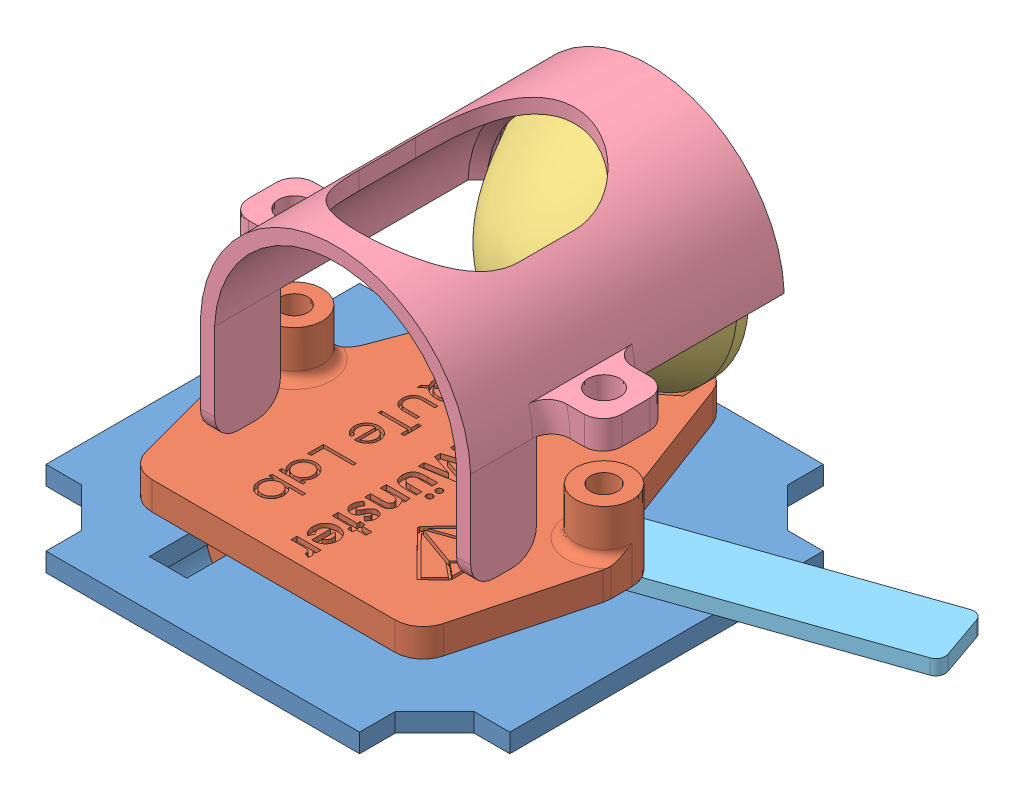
SolidWorks assembly Baugr3.SLDASM, configuration Standard (file format 15000). Lengths in mm.
Overall size (67.78 50 49.4).
5 component instances, 5 part files, 10 mates.
Components (placement in the parent):
- Lens_Inset-1: Lens_Inset.SLDPRT [Standard] at (-5.4305 -44.5167 0) size (50 50 49.4)
- Lens_Mount_Slide-1: Lens_Mount_Slide.SLDPRT [Long] at (-5.4805 -39.3667 -18.8929) size (39 17.6 40)
- ACL25416U-Solidworks-1: ACL25416U-Solidworks.sldprt [Default] at (-5.4805 -27.5167 -8.1381) x (0.055047 -0.998484 0) z (0.998484 0.055047 0) size (25.4 14 25.4)
- Lens_Mount_Clamp-1: Lens_Mount_Clamp.SLDPRT [Standard] at (-5.4805 -27.5167 -19.4929) x (-1 0 0) z (0 0 -1) size (39.78 24.75 33.4)
- Lens_Mount_Lever-1: Lens_Mount_Lever.SLDPRT [Standard] at (7.8695 -42.5167 -4.7) x (-0.944337 0 0.328979) z (-0.328979 0 -0.944337) size (55 3.6 7)
Mates (geometry in assembly coordinates):
- Abstand1: distance = 1.65 mm anti-aligned: plane of Linse_unten-1 through (-22.9805 -40.8667 -13.8929) normal (0 -1 0); plane of boden-1 through (-5.4305 -42.5167 0) normal (0 1 0)
- Konzentrisch1: concentric anti-aligned: cylinder of Linse_unten-1 through (-5.4805 -27.5167 -18.893) axis (0 0 1) radius 12.85; cylinder of ACL25416U-Solidworks-1 through (-5.4805 -27.5167 -22.1381) axis (0 0 -1) radius 12.7
- Tangential1: tangent anti-aligned: plane of Linse_unten-1 through (-5.4805 -52.0449 -18.893) normal (0 0.173648 0.984808); torus of ACL25416U-Solidworks-1
- Parallel8: parallel aligned: plane of Linse_unten-1 through (-22.9805 -37.8667 -13.8929) normal (0 1 0); plane of Lens_Mount_Clamp-1 through (-5.4805 -24.0167 -19.4929) normal (0 1 0)
- Konzentrisch2: concentric anti-aligned: cylinder of ACL25416U-Solidworks-1 through (-5.4805 -27.5167 -22.1381) axis (0 0 -1) radius 12.7; cylinder of Lens_Mount_Clamp-1 through (-5.4805 -27.5167 -20.4929) axis (0 0 1) radius 12.9
- Konzentrisch3: concentric aligned: cylinder of boden-1 through (7.8695 -50.5167 -4.7) axis (0 1 0) radius 2; cylinder of Teil8-1 through (7.8695 -44.5167 -4.7) axis (0 1 0) radius 1.9
- Deckungsgleich3: coincident anti-aligned: plane of boden-1 through (-5.4305 -42.5167 0) normal (0 1 0); plane of Teil8-1 through (7.8695 -42.5167 -4.7) normal (0 -1 0)
- Tangential2: tangent aligned: cylinder of Linse_unten-1 through (-14.1805 -52.6798 6.1071) axis (0 1 0) radius 1.95; cylinder of Teil8-1 through (26.1236 -40.9167 123.6914) axis (0 -1 0) radius 126.25
- Deckungsgleich4: coincident anti-aligned: plane of boden-1 through (-16.1305 -50.5167 -24.7) normal (1 0 0); plane of Linse_unten-1 through (-16.1305 -39.3667 10.1071) normal (-1 0 0)
- Deckungsgleich5: coincident aligned: plane of Linse_unten-1 through (-5.4805 -39.3667 -22.8929) normal (0 0 -1); plane of Lens_Mount_Clamp-1 through (-5.4805 -27.5167 -22.8929) normal (0 0 -1)
